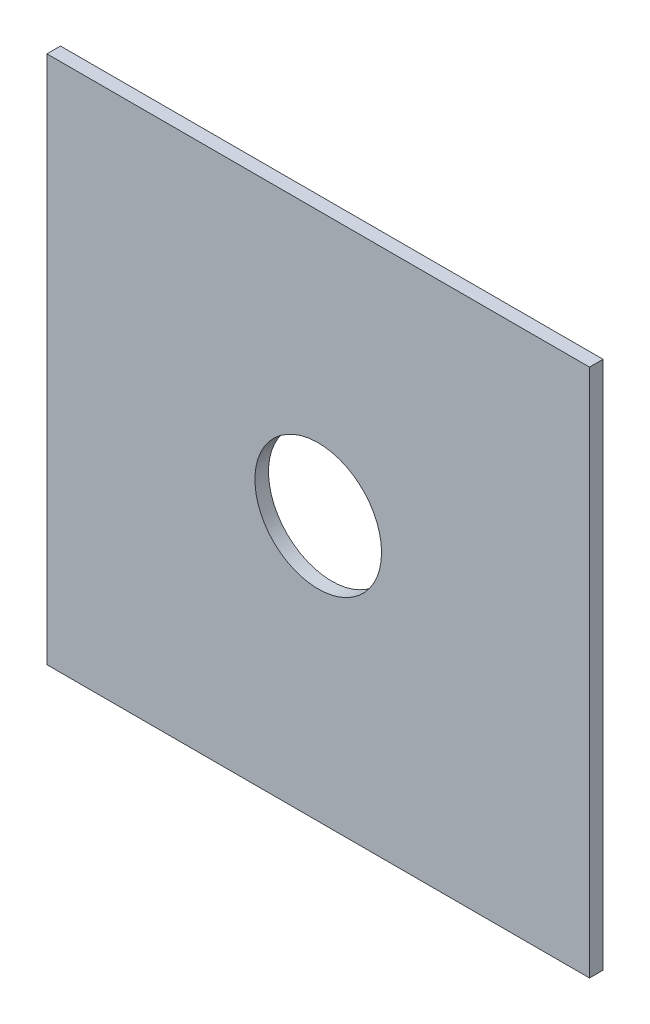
ISO-10303-21;
HEADER;
FILE_DESCRIPTION(('STEP AP214'),'2;1');
FILE_NAME('part.step','',(''),(''),'','','');
FILE_SCHEMA(('AUTOMOTIVE_DESIGN { 1 0 10303 214 1 1 1 1 }'));
ENDSEC;
DATA;
#1=APPLICATION_CONTEXT('core data for automotive mechanical design processes');
#2=APPLICATION_PROTOCOL_DEFINITION('international standard','automotive_design',2000,#1);
#3=PRODUCT_CONTEXT('',#1,'mechanical');
#4=PRODUCT('Part','Part','',(#3));
#5=PRODUCT_RELATED_PRODUCT_CATEGORY('part','',(#4));
#6=PRODUCT_DEFINITION_FORMATION('','',#4);
#7=PRODUCT_DEFINITION_CONTEXT('part definition',#1,'design');
#8=PRODUCT_DEFINITION('design','',#6,#7);
#9=PRODUCT_DEFINITION_SHAPE('','',#8);
#10=(LENGTH_UNIT() NAMED_UNIT(*) SI_UNIT(.MILLI.,.METRE.));
#11=(NAMED_UNIT(*) PLANE_ANGLE_UNIT() SI_UNIT($,.RADIAN.));
#12=(NAMED_UNIT(*) SI_UNIT($,.STERADIAN.) SOLID_ANGLE_UNIT());
#13=UNCERTAINTY_MEASURE_WITH_UNIT(LENGTH_MEASURE(1.E-05),#10,'distance_accuracy_value','');
#14=(GEOMETRIC_REPRESENTATION_CONTEXT(3) GLOBAL_UNCERTAINTY_ASSIGNED_CONTEXT((#13)) GLOBAL_UNIT_ASSIGNED_CONTEXT((#10,
#11,#12)) REPRESENTATION_CONTEXT('',''));
#15=CARTESIAN_POINT('',(0.,0.,0.));
#16=DIRECTION('',(0.,0.,1.));
#17=DIRECTION('',(1.,0.,0.));
#18=AXIS2_PLACEMENT_3D('',#15,#16,#17);
#19=CARTESIAN_POINT('',(300.,292.5,15.));
#20=DIRECTION('',(-1.,0.,0.));
#21=DIRECTION('',(0.,-1.,0.));
#22=AXIS2_PLACEMENT_3D('',#19,#20,#21);
#23=PLANE('',#22);
#24=DIRECTION('',(0.,1.,0.));
#25=VECTOR('',#24,1.);
#26=CARTESIAN_POINT('',(300.,292.5,0.));
#27=LINE('',#26,#25);
#28=CARTESIAN_POINT('',(300.,-292.5,0.));
#29=VERTEX_POINT('',#28);
#30=CARTESIAN_POINT('',(300.,292.5,0.));
#31=VERTEX_POINT('',#30);
#32=EDGE_CURVE('E110',#29,#31,#27,.T.);
#33=ORIENTED_EDGE('',*,*,#32,.T.);
#34=DIRECTION('',(0.,0.,-1.));
#35=VECTOR('',#34,1.);
#36=CARTESIAN_POINT('',(300.,292.5,15.));
#37=LINE('',#36,#35);
#38=CARTESIAN_POINT('',(300.,292.5,15.));
#39=VERTEX_POINT('',#38);
#40=EDGE_CURVE('E11',#39,#31,#37,.T.);
#41=ORIENTED_EDGE('',*,*,#40,.F.);
#42=DIRECTION('',(0.,1.,0.));
#43=VECTOR('',#42,1.);
#44=CARTESIAN_POINT('',(300.,292.5,15.));
#45=LINE('',#44,#43);
#46=CARTESIAN_POINT('',(300.,-292.5,15.));
#47=VERTEX_POINT('',#46);
#48=EDGE_CURVE('E94',#47,#39,#45,.T.);
#49=ORIENTED_EDGE('',*,*,#48,.F.);
#50=DIRECTION('',(0.,0.,-1.));
#51=VECTOR('',#50,1.);
#52=CARTESIAN_POINT('',(300.,-292.5,15.));
#53=LINE('',#52,#51);
#54=EDGE_CURVE('E106',#47,#29,#53,.T.);
#55=ORIENTED_EDGE('',*,*,#54,.T.);
#56=EDGE_LOOP('',(#33,#41,#49,#55));
#57=FACE_BOUND('',#56,.T.);
#58=ADVANCED_FACE('F42',(#57),#23,.F.);
#59=CARTESIAN_POINT('',(-300.,292.5,15.));
#60=DIRECTION('',(0.,-1.,0.));
#61=DIRECTION('',(0.,0.,-1.));
#62=AXIS2_PLACEMENT_3D('',#59,#60,#61);
#63=PLANE('',#62);
#64=DIRECTION('',(-1.,0.,0.));
#65=VECTOR('',#64,1.);
#66=CARTESIAN_POINT('',(-300.,292.5,0.));
#67=LINE('',#66,#65);
#68=CARTESIAN_POINT('',(-300.,292.5,0.));
#69=VERTEX_POINT('',#68);
#70=EDGE_CURVE('E99',#31,#69,#67,.T.);
#71=ORIENTED_EDGE('',*,*,#70,.T.);
#72=DIRECTION('',(0.,0.,-1.));
#73=VECTOR('',#72,1.);
#74=CARTESIAN_POINT('',(-300.,292.5,15.));
#75=LINE('',#74,#73);
#76=CARTESIAN_POINT('',(-300.,292.5,15.));
#77=VERTEX_POINT('',#76);
#78=EDGE_CURVE('E51',#77,#69,#75,.T.);
#79=ORIENTED_EDGE('',*,*,#78,.F.);
#80=DIRECTION('',(-1.,0.,0.));
#81=VECTOR('',#80,1.);
#82=CARTESIAN_POINT('',(-300.,292.5,15.));
#83=LINE('',#82,#81);
#84=EDGE_CURVE('E89',#39,#77,#83,.T.);
#85=ORIENTED_EDGE('',*,*,#84,.F.);
#86=ORIENTED_EDGE('',*,*,#40,.T.);
#87=EDGE_LOOP('',(#71,#79,#85,#86));
#88=FACE_BOUND('',#87,.T.);
#89=ADVANCED_FACE('F98',(#88),#63,.F.);
#90=CARTESIAN_POINT('',(-300.,292.5,15.));
#91=DIRECTION('',(1.,0.,0.));
#92=DIRECTION('',(0.,0.,-1.));
#93=AXIS2_PLACEMENT_3D('',#90,#91,#92);
#94=PLANE('',#93);
#95=DIRECTION('',(0.,-1.,0.));
#96=VECTOR('',#95,1.);
#97=CARTESIAN_POINT('',(-300.,292.5,0.));
#98=LINE('',#97,#96);
#99=CARTESIAN_POINT('',(-300.,-292.5,0.));
#100=VERTEX_POINT('',#99);
#101=EDGE_CURVE('E76',#69,#100,#98,.T.);
#102=ORIENTED_EDGE('',*,*,#101,.T.);
#103=DIRECTION('',(0.,0.,-1.));
#104=VECTOR('',#103,1.);
#105=CARTESIAN_POINT('',(-300.,-292.5,15.));
#106=LINE('',#105,#104);
#107=CARTESIAN_POINT('',(-300.,-292.5,15.));
#108=VERTEX_POINT('',#107);
#109=EDGE_CURVE('E101',#108,#100,#106,.T.);
#110=ORIENTED_EDGE('',*,*,#109,.F.);
#111=DIRECTION('',(0.,-1.,0.));
#112=VECTOR('',#111,1.);
#113=CARTESIAN_POINT('',(-300.,292.5,15.));
#114=LINE('',#113,#112);
#115=EDGE_CURVE('E92',#77,#108,#114,.T.);
#116=ORIENTED_EDGE('',*,*,#115,.F.);
#117=ORIENTED_EDGE('',*,*,#78,.T.);
#118=EDGE_LOOP('',(#102,#110,#116,#117));
#119=FACE_BOUND('',#118,.T.);
#120=ADVANCED_FACE('F102',(#119),#94,.F.);
#121=CARTESIAN_POINT('',(-300.,-292.5,15.));
#122=DIRECTION('',(0.,1.,0.));
#123=DIRECTION('',(0.,0.,1.));
#124=AXIS2_PLACEMENT_3D('',#121,#122,#123);
#125=PLANE('',#124);
#126=DIRECTION('',(1.,0.,0.));
#127=VECTOR('',#126,1.);
#128=CARTESIAN_POINT('',(-300.,-292.5,0.));
#129=LINE('',#128,#127);
#130=EDGE_CURVE('E82',#100,#29,#129,.T.);
#131=ORIENTED_EDGE('',*,*,#130,.T.);
#132=ORIENTED_EDGE('',*,*,#54,.F.);
#133=DIRECTION('',(1.,0.,0.));
#134=VECTOR('',#133,1.);
#135=CARTESIAN_POINT('',(-300.,-292.5,15.));
#136=LINE('',#135,#134);
#137=EDGE_CURVE('E59',#108,#47,#136,.T.);
#138=ORIENTED_EDGE('',*,*,#137,.F.);
#139=ORIENTED_EDGE('',*,*,#109,.T.);
#140=EDGE_LOOP('',(#131,#132,#138,#139));
#141=FACE_BOUND('',#140,.T.);
#142=ADVANCED_FACE('F124',(#141),#125,.F.);
#143=CARTESIAN_POINT('',(0.,0.,15.));
#144=DIRECTION('',(0.,0.,1.));
#145=DIRECTION('',(1.,0.,0.));
#146=AXIS2_PLACEMENT_3D('',#143,#144,#145);
#147=PLANE('',#146);
#148=CARTESIAN_POINT('',(0.,0.,15.));
#149=DIRECTION('',(0.,0.,1.));
#150=DIRECTION('',(1.,0.,0.));
#151=AXIS2_PLACEMENT_3D('',#148,#149,#150);
#152=CIRCLE('',#151,70.);
#153=CARTESIAN_POINT('',(70.,0.,15.));
#154=VERTEX_POINT('',#153);
#155=EDGE_CURVE('E131',#154,#154,#152,.T.);
#156=ORIENTED_EDGE('',*,*,#155,.F.);
#157=EDGE_LOOP('',(#156));
#158=FACE_BOUND('',#157,.T.);
#159=ORIENTED_EDGE('',*,*,#48,.T.);
#160=ORIENTED_EDGE('',*,*,#84,.T.);
#161=ORIENTED_EDGE('',*,*,#115,.T.);
#162=ORIENTED_EDGE('',*,*,#137,.T.);
#163=EDGE_LOOP('',(#159,#160,#161,#162));
#164=FACE_BOUND('',#163,.T.);
#165=ADVANCED_FACE('F90',(#158,#164),#147,.T.);
#166=CARTESIAN_POINT('',(0.,0.,0.));
#167=DIRECTION('',(0.,0.,1.));
#168=DIRECTION('',(1.,0.,0.));
#169=AXIS2_PLACEMENT_3D('',#166,#167,#168);
#170=PLANE('',#169);
#171=CARTESIAN_POINT('',(0.,0.,0.));
#172=DIRECTION('',(0.,0.,1.));
#173=DIRECTION('',(1.,0.,0.));
#174=AXIS2_PLACEMENT_3D('',#171,#172,#173);
#175=CIRCLE('',#174,70.);
#176=CARTESIAN_POINT('',(70.,0.,0.));
#177=VERTEX_POINT('',#176);
#178=EDGE_CURVE('E114',#177,#177,#175,.T.);
#179=ORIENTED_EDGE('',*,*,#178,.T.);
#180=EDGE_LOOP('',(#179));
#181=FACE_BOUND('',#180,.T.);
#182=ORIENTED_EDGE('',*,*,#32,.F.);
#183=ORIENTED_EDGE('',*,*,#130,.F.);
#184=ORIENTED_EDGE('',*,*,#101,.F.);
#185=ORIENTED_EDGE('',*,*,#70,.F.);
#186=EDGE_LOOP('',(#182,#183,#184,#185));
#187=FACE_BOUND('',#186,.T.);
#188=ADVANCED_FACE('F127',(#181,#187),#170,.F.);
#189=CARTESIAN_POINT('',(0.,0.,0.));
#190=DIRECTION('',(0.,0.,1.));
#191=DIRECTION('',(1.,0.,0.));
#192=AXIS2_PLACEMENT_3D('',#189,#190,#191);
#193=CYLINDRICAL_SURFACE('',#192,70.);
#194=ORIENTED_EDGE('',*,*,#178,.F.);
#195=EDGE_LOOP('',(#194));
#196=FACE_BOUND('',#195,.T.);
#197=ORIENTED_EDGE('',*,*,#155,.T.);
#198=EDGE_LOOP('',(#197));
#199=FACE_BOUND('',#198,.T.);
#200=ADVANCED_FACE('F140',(#196,#199),#193,.F.);
#201=CLOSED_SHELL('',(#58,#89,#120,#142,#165,#188,#200));
#202=MANIFOLD_SOLID_BREP('B2',#201);
#203=ADVANCED_BREP_SHAPE_REPRESENTATION('',(#18,#202),#14);
#204=SHAPE_DEFINITION_REPRESENTATION(#9,#203);
ENDSEC;
END-ISO-10303-21;
